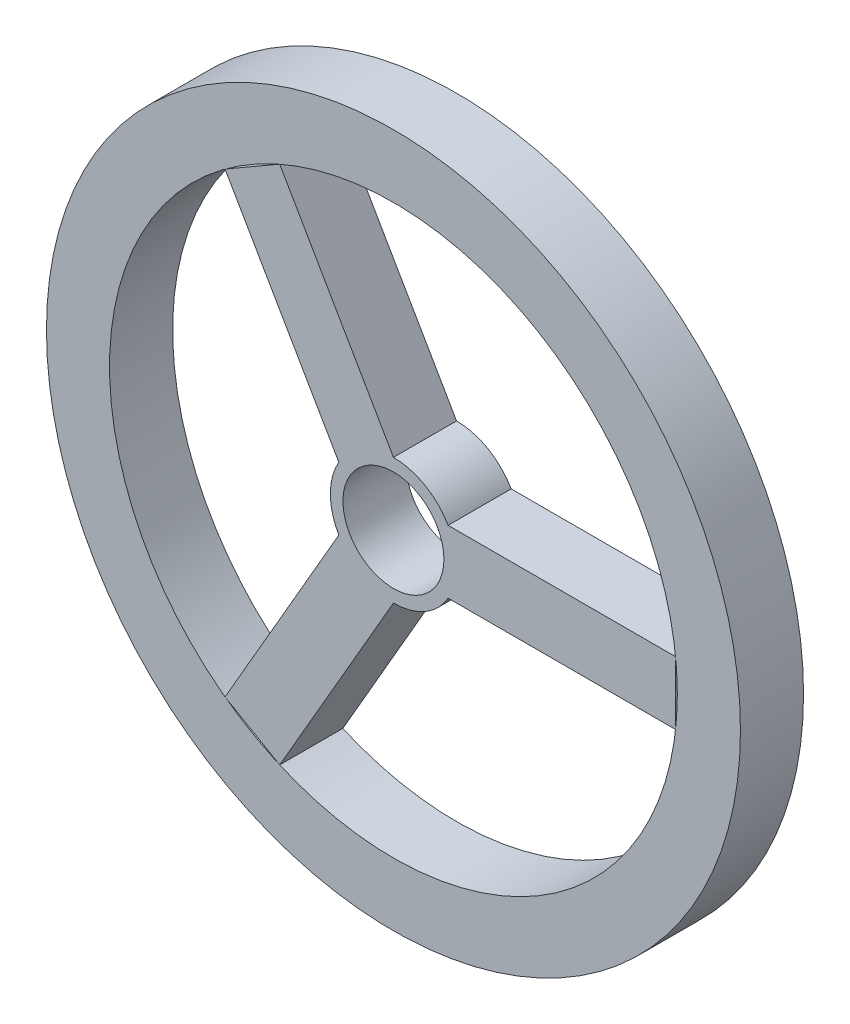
from build123d import *

# Parameters (mm, degrees)
ESQUISSE1_R          = 8
BOSS_EXTRU_1_DEPTH   = 10
ESQUISSE1_R_2        = 55
BOSS_EXTRU_1_2_DEPTH = 10


with BuildPart() as part:
    # Esquisse1 → Boss.-Extru.1 (new body)
    with BuildSketch(Plane.XY):
        with BuildLine():
            Line((8.660254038, -5), (44.72135955, -5))
            Line((44.72135955, -5), (44.72135955, 5))
            Line((44.72135955, 5), (8.660254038, 5))
            ThreePointArc((8.660254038, 5), (5, 8.660254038), (0, 10))
            Line((0, 10), (-18.030552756, 41.229833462))
            Line((-18.030552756, 41.229833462), (-26.690806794, 36.229833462))
            Line((-26.690806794, 36.229833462), (-8.660254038, 5))
            ThreePointArc((-8.660254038, 5), (-10, 0), (-8.660254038, -5))
            Line((-8.660254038, -5), (-26.690806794, -36.229833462))
            Line((-26.690806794, -36.229833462), (-18.030552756, -41.229833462))
            Line((-18.030552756, -41.229833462), (0, -10))
            ThreePointArc((0, -10), (5, -8.660254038), (8.660254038, -5))
        make_face()
        Circle(ESQUISSE1_R, mode=Mode.SUBTRACT)
    extrude(amount=BOSS_EXTRU_1_DEPTH)


with BuildPart() as body_2:
    # Esquisse1 → Boss.-Extru.1 2 (new body)
    with BuildSketch(Plane.XY):
        Circle(ESQUISSE1_R_2)
        with BuildLine():
            ThreePointArc((-18.030552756, 41.229833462), (22.5, 38.97114317), (44.72135955, 5))
            ThreePointArc((44.72135955, 5), (45, 0), (44.72135955, -5))
            ThreePointArc((44.72135955, -5), (22.5, -38.97114317), (-18.030552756, -41.229833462))
            ThreePointArc((-18.030552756, -41.229833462), (-22.5, -38.97114317), (-26.690806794, -36.229833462))
            ThreePointArc((-26.690806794, -36.229833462), (-45, 0), (-26.690806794, 36.229833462))
            ThreePointArc((-26.690806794, 36.229833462), (-22.5, 38.97114317), (-18.030552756, 41.229833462))
        make_face(mode=Mode.SUBTRACT)
    extrude(amount=BOSS_EXTRU_1_2_DEPTH)


solid = Compound([part.part, body_2.part])
